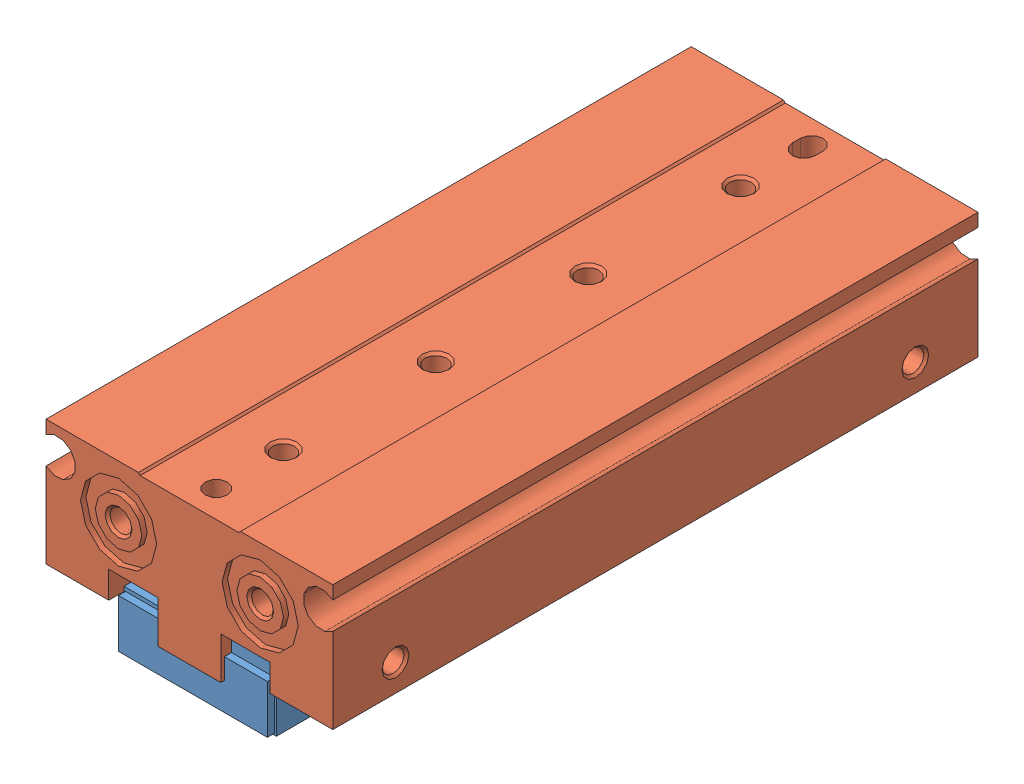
SolidWorks assembly SHF8-32D.sldasm, configuration Default (file format 11000). Lengths in mm.
Overall size (32 19 72).
3 component instances, 2 part files, 0 mates.
Components (placement in the parent):
- SHF8-3202-1: SHF8-3202.sldprt [Default] at (0 -19 -16) x (-1 0 0) z (0 0 -1) size (17 9.6 46.7)
- SHF8-3202-2: SHF8-3202.sldprt [Default] at (0 -19 16) size (17 9.6 46.7)
- SHF8-3201-1: SHF8-3201.sldprt [Default] at origin size (32 15.7 72)
